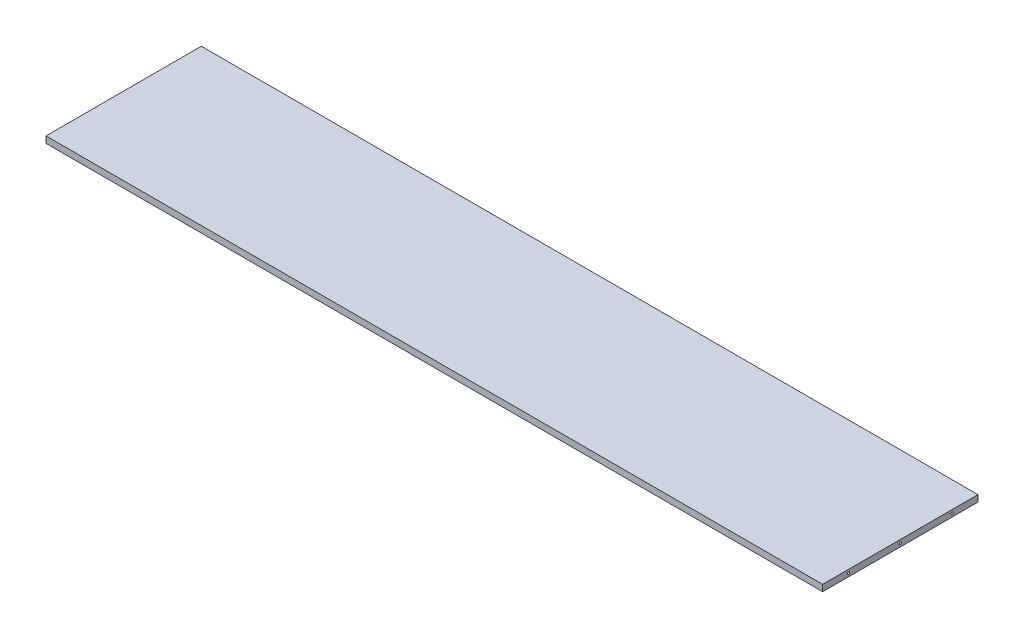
ISO-10303-21;
HEADER;
FILE_DESCRIPTION(('STEP AP214'),'2;1');
FILE_NAME('part.step','',(''),(''),'','','');
FILE_SCHEMA(('AUTOMOTIVE_DESIGN { 1 0 10303 214 1 1 1 1 }'));
ENDSEC;
DATA;
#1=APPLICATION_CONTEXT('core data for automotive mechanical design processes');
#2=APPLICATION_PROTOCOL_DEFINITION('international standard','automotive_design',2000,#1);
#3=PRODUCT_CONTEXT('',#1,'mechanical');
#4=PRODUCT('Part','Part','',(#3));
#5=PRODUCT_RELATED_PRODUCT_CATEGORY('part','',(#4));
#6=PRODUCT_DEFINITION_FORMATION('','',#4);
#7=PRODUCT_DEFINITION_CONTEXT('part definition',#1,'design');
#8=PRODUCT_DEFINITION('design','',#6,#7);
#9=PRODUCT_DEFINITION_SHAPE('','',#8);
#10=(LENGTH_UNIT() NAMED_UNIT(*) SI_UNIT(.MILLI.,.METRE.));
#11=(NAMED_UNIT(*) PLANE_ANGLE_UNIT() SI_UNIT($,.RADIAN.));
#12=(NAMED_UNIT(*) SI_UNIT($,.STERADIAN.) SOLID_ANGLE_UNIT());
#13=UNCERTAINTY_MEASURE_WITH_UNIT(LENGTH_MEASURE(1.E-05),#10,'distance_accuracy_value','');
#14=(GEOMETRIC_REPRESENTATION_CONTEXT(3) GLOBAL_UNCERTAINTY_ASSIGNED_CONTEXT((#13)) GLOBAL_UNIT_ASSIGNED_CONTEXT((#10,
#11,#12)) REPRESENTATION_CONTEXT('',''));
#15=CARTESIAN_POINT('',(0.,0.,0.));
#16=DIRECTION('',(0.,0.,1.));
#17=DIRECTION('',(1.,0.,0.));
#18=AXIS2_PLACEMENT_3D('',#15,#16,#17);
#19=CARTESIAN_POINT('',(381.,6.35,76.2));
#20=DIRECTION('',(-1.,0.,0.));
#21=DIRECTION('',(0.,0.,1.));
#22=AXIS2_PLACEMENT_3D('',#19,#20,#21);
#23=PLANE('',#22);
#24=CARTESIAN_POINT('',(381.,3.175,0.));
#25=DIRECTION('',(1.,0.,0.));
#26=DIRECTION('',(0.,0.,-1.));
#27=AXIS2_PLACEMENT_3D('',#24,#25,#26);
#28=CIRCLE('',#27,1.1303);
#29=CARTESIAN_POINT('',(381.,3.175,-1.1303));
#30=VERTEX_POINT('',#29);
#31=EDGE_CURVE('E130',#30,#30,#28,.T.);
#32=ORIENTED_EDGE('',*,*,#31,.F.);
#33=EDGE_LOOP('',(#32));
#34=FACE_BOUND('',#33,.T.);
#35=CARTESIAN_POINT('',(381.,3.175,-50.8));
#36=DIRECTION('',(1.,0.,0.));
#37=DIRECTION('',(0.,0.,-1.));
#38=AXIS2_PLACEMENT_3D('',#35,#36,#37);
#39=CIRCLE('',#38,1.1303);
#40=CARTESIAN_POINT('',(381.,3.175,-51.9303));
#41=VERTEX_POINT('',#40);
#42=EDGE_CURVE('E136',#41,#41,#39,.T.);
#43=ORIENTED_EDGE('',*,*,#42,.F.);
#44=EDGE_LOOP('',(#43));
#45=FACE_BOUND('',#44,.T.);
#46=CARTESIAN_POINT('',(381.,3.175,50.8));
#47=DIRECTION('',(1.,0.,0.));
#48=DIRECTION('',(0.,0.,-1.));
#49=AXIS2_PLACEMENT_3D('',#46,#47,#48);
#50=CIRCLE('',#49,1.1303);
#51=CARTESIAN_POINT('',(381.,3.175,49.6697));
#52=VERTEX_POINT('',#51);
#53=EDGE_CURVE('E142',#52,#52,#50,.T.);
#54=ORIENTED_EDGE('',*,*,#53,.F.);
#55=EDGE_LOOP('',(#54));
#56=FACE_BOUND('',#55,.T.);
#57=DIRECTION('',(0.,0.,-1.));
#58=VECTOR('',#57,1.);
#59=CARTESIAN_POINT('',(381.,0.,76.2));
#60=LINE('',#59,#58);
#61=CARTESIAN_POINT('',(381.,0.,76.2));
#62=VERTEX_POINT('',#61);
#63=CARTESIAN_POINT('',(381.,0.,-76.2));
#64=VERTEX_POINT('',#63);
#65=EDGE_CURVE('E148',#62,#64,#60,.T.);
#66=ORIENTED_EDGE('',*,*,#65,.T.);
#67=DIRECTION('',(0.,-1.,0.));
#68=VECTOR('',#67,1.);
#69=CARTESIAN_POINT('',(381.,6.35,-76.2));
#70=LINE('',#69,#68);
#71=CARTESIAN_POINT('',(381.,6.35,-76.2));
#72=VERTEX_POINT('',#71);
#73=EDGE_CURVE('E11',#72,#64,#70,.T.);
#74=ORIENTED_EDGE('',*,*,#73,.F.);
#75=DIRECTION('',(0.,0.,-1.));
#76=VECTOR('',#75,1.);
#77=CARTESIAN_POINT('',(381.,6.35,76.2));
#78=LINE('',#77,#76);
#79=CARTESIAN_POINT('',(381.,6.35,76.2));
#80=VERTEX_POINT('',#79);
#81=EDGE_CURVE('E149',#80,#72,#78,.T.);
#82=ORIENTED_EDGE('',*,*,#81,.F.);
#83=DIRECTION('',(0.,-1.,0.));
#84=VECTOR('',#83,1.);
#85=CARTESIAN_POINT('',(381.,6.35,76.2));
#86=LINE('',#85,#84);
#87=EDGE_CURVE('E155',#80,#62,#86,.T.);
#88=ORIENTED_EDGE('',*,*,#87,.T.);
#89=EDGE_LOOP('',(#66,#74,#82,#88));
#90=FACE_BOUND('',#89,.T.);
#91=ADVANCED_FACE('F37',(#34,#45,#56,#90),#23,.F.);
#92=CARTESIAN_POINT('',(-381.,6.35,-76.2));
#93=DIRECTION('',(0.,0.,1.));
#94=DIRECTION('',(1.,0.,0.));
#95=AXIS2_PLACEMENT_3D('',#92,#93,#94);
#96=PLANE('',#95);
#97=DIRECTION('',(-1.,0.,0.));
#98=VECTOR('',#97,1.);
#99=CARTESIAN_POINT('',(-381.,0.,-76.2));
#100=LINE('',#99,#98);
#101=CARTESIAN_POINT('',(-381.,0.,-76.2));
#102=VERTEX_POINT('',#101);
#103=EDGE_CURVE('E158',#64,#102,#100,.T.);
#104=ORIENTED_EDGE('',*,*,#103,.T.);
#105=DIRECTION('',(0.,-1.,0.));
#106=VECTOR('',#105,1.);
#107=CARTESIAN_POINT('',(-381.,6.35,-76.2));
#108=LINE('',#107,#106);
#109=CARTESIAN_POINT('',(-381.,6.35,-76.2));
#110=VERTEX_POINT('',#109);
#111=EDGE_CURVE('E45',#110,#102,#108,.T.);
#112=ORIENTED_EDGE('',*,*,#111,.F.);
#113=DIRECTION('',(-1.,0.,0.));
#114=VECTOR('',#113,1.);
#115=CARTESIAN_POINT('',(-381.,6.35,-76.2));
#116=LINE('',#115,#114);
#117=EDGE_CURVE('E84',#72,#110,#116,.T.);
#118=ORIENTED_EDGE('',*,*,#117,.F.);
#119=ORIENTED_EDGE('',*,*,#73,.T.);
#120=EDGE_LOOP('',(#104,#112,#118,#119));
#121=FACE_BOUND('',#120,.T.);
#122=ADVANCED_FACE('F181',(#121),#96,.F.);
#123=CARTESIAN_POINT('',(-381.,6.35,76.2));
#124=DIRECTION('',(1.,0.,0.));
#125=DIRECTION('',(0.,0.,-1.));
#126=AXIS2_PLACEMENT_3D('',#123,#124,#125);
#127=PLANE('',#126);
#128=CARTESIAN_POINT('',(-381.,3.175,0.));
#129=DIRECTION('',(-1.,0.,0.));
#130=DIRECTION('',(0.,0.,1.));
#131=AXIS2_PLACEMENT_3D('',#128,#129,#130);
#132=CIRCLE('',#131,1.13029999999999);
#133=CARTESIAN_POINT('',(-381.,3.175,1.13029999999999));
#134=VERTEX_POINT('',#133);
#135=EDGE_CURVE('E114',#134,#134,#132,.T.);
#136=ORIENTED_EDGE('',*,*,#135,.F.);
#137=EDGE_LOOP('',(#136));
#138=FACE_BOUND('',#137,.T.);
#139=CARTESIAN_POINT('',(-381.,3.175,50.8));
#140=DIRECTION('',(-1.,0.,0.));
#141=DIRECTION('',(0.,0.,1.));
#142=AXIS2_PLACEMENT_3D('',#139,#140,#141);
#143=CIRCLE('',#142,1.13029999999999);
#144=CARTESIAN_POINT('',(-381.,3.175,51.9303));
#145=VERTEX_POINT('',#144);
#146=EDGE_CURVE('E113',#145,#145,#143,.T.);
#147=ORIENTED_EDGE('',*,*,#146,.F.);
#148=EDGE_LOOP('',(#147));
#149=FACE_BOUND('',#148,.T.);
#150=CARTESIAN_POINT('',(-381.,3.175,-50.8));
#151=DIRECTION('',(-1.,0.,0.));
#152=DIRECTION('',(0.,0.,1.));
#153=AXIS2_PLACEMENT_3D('',#150,#151,#152);
#154=CIRCLE('',#153,1.13029999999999);
#155=CARTESIAN_POINT('',(-381.,3.175,-49.6697));
#156=VERTEX_POINT('',#155);
#157=EDGE_CURVE('E124',#156,#156,#154,.T.);
#158=ORIENTED_EDGE('',*,*,#157,.F.);
#159=EDGE_LOOP('',(#158));
#160=FACE_BOUND('',#159,.T.);
#161=DIRECTION('',(0.,0.,1.));
#162=VECTOR('',#161,1.);
#163=CARTESIAN_POINT('',(-381.,0.,76.2));
#164=LINE('',#163,#162);
#165=CARTESIAN_POINT('',(-381.,0.,76.2));
#166=VERTEX_POINT('',#165);
#167=EDGE_CURVE('E71',#102,#166,#164,.T.);
#168=ORIENTED_EDGE('',*,*,#167,.T.);
#169=DIRECTION('',(0.,-1.,0.));
#170=VECTOR('',#169,1.);
#171=CARTESIAN_POINT('',(-381.,6.35,76.2));
#172=LINE('',#171,#170);
#173=CARTESIAN_POINT('',(-381.,6.35,76.2));
#174=VERTEX_POINT('',#173);
#175=EDGE_CURVE('E163',#174,#166,#172,.T.);
#176=ORIENTED_EDGE('',*,*,#175,.F.);
#177=DIRECTION('',(0.,0.,1.));
#178=VECTOR('',#177,1.);
#179=CARTESIAN_POINT('',(-381.,6.35,76.2));
#180=LINE('',#179,#178);
#181=EDGE_CURVE('E152',#110,#174,#180,.T.);
#182=ORIENTED_EDGE('',*,*,#181,.F.);
#183=ORIENTED_EDGE('',*,*,#111,.T.);
#184=EDGE_LOOP('',(#168,#176,#182,#183));
#185=FACE_BOUND('',#184,.T.);
#186=ADVANCED_FACE('F165',(#138,#149,#160,#185),#127,.F.);
#187=CARTESIAN_POINT('',(-381.,6.35,76.2));
#188=DIRECTION('',(0.,0.,-1.));
#189=DIRECTION('',(-1.,0.,0.));
#190=AXIS2_PLACEMENT_3D('',#187,#188,#189);
#191=PLANE('',#190);
#192=DIRECTION('',(1.,0.,0.));
#193=VECTOR('',#192,1.);
#194=CARTESIAN_POINT('',(-381.,0.,76.2));
#195=LINE('',#194,#193);
#196=EDGE_CURVE('E77',#166,#62,#195,.T.);
#197=ORIENTED_EDGE('',*,*,#196,.T.);
#198=ORIENTED_EDGE('',*,*,#87,.F.);
#199=DIRECTION('',(1.,0.,0.));
#200=VECTOR('',#199,1.);
#201=CARTESIAN_POINT('',(-381.,6.35,76.2));
#202=LINE('',#201,#200);
#203=EDGE_CURVE('E53',#174,#80,#202,.T.);
#204=ORIENTED_EDGE('',*,*,#203,.F.);
#205=ORIENTED_EDGE('',*,*,#175,.T.);
#206=EDGE_LOOP('',(#197,#198,#204,#205));
#207=FACE_BOUND('',#206,.T.);
#208=ADVANCED_FACE('F172',(#207),#191,.F.);
#209=CARTESIAN_POINT('',(0.,6.35,0.));
#210=DIRECTION('',(0.,-1.,0.));
#211=DIRECTION('',(0.,0.,-1.));
#212=AXIS2_PLACEMENT_3D('',#209,#210,#211);
#213=PLANE('',#212);
#214=ORIENTED_EDGE('',*,*,#81,.T.);
#215=ORIENTED_EDGE('',*,*,#117,.T.);
#216=ORIENTED_EDGE('',*,*,#181,.T.);
#217=ORIENTED_EDGE('',*,*,#203,.T.);
#218=EDGE_LOOP('',(#214,#215,#216,#217));
#219=FACE_BOUND('',#218,.T.);
#220=ADVANCED_FACE('F174',(#219),#213,.F.);
#221=CARTESIAN_POINT('',(0.,0.,0.));
#222=DIRECTION('',(0.,-1.,0.));
#223=DIRECTION('',(0.,0.,-1.));
#224=AXIS2_PLACEMENT_3D('',#221,#222,#223);
#225=PLANE('',#224);
#226=ORIENTED_EDGE('',*,*,#65,.F.);
#227=ORIENTED_EDGE('',*,*,#196,.F.);
#228=ORIENTED_EDGE('',*,*,#167,.F.);
#229=ORIENTED_EDGE('',*,*,#103,.F.);
#230=EDGE_LOOP('',(#226,#227,#228,#229));
#231=FACE_BOUND('',#230,.T.);
#232=ADVANCED_FACE('F168',(#231),#225,.T.);
#233=CARTESIAN_POINT('',(373.4054,3.175,50.8));
#234=DIRECTION('',(1.,0.,0.));
#235=DIRECTION('',(0.,0.,-1.));
#236=AXIS2_PLACEMENT_3D('',#233,#234,#235);
#237=CONICAL_SURFACE('',#236,1.1303,1.02974425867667);
#238=CARTESIAN_POINT('',(372.726247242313,3.175,50.8));
#239=VERTEX_POINT('',#238);
#240=VERTEX_LOOP('',#239);
#241=FACE_BOUND('',#240,.T.);
#242=CARTESIAN_POINT('',(373.4054,3.175,50.8));
#243=DIRECTION('',(1.,0.,0.));
#244=DIRECTION('',(0.,0.,-1.));
#245=AXIS2_PLACEMENT_3D('',#242,#243,#244);
#246=CIRCLE('',#245,1.1303);
#247=CARTESIAN_POINT('',(373.4054,3.175,49.6697));
#248=VERTEX_POINT('',#247);
#249=EDGE_CURVE('E145',#248,#248,#246,.T.);
#250=ORIENTED_EDGE('',*,*,#249,.T.);
#251=EDGE_LOOP('',(#250));
#252=FACE_BOUND('',#251,.T.);
#253=ADVANCED_FACE('F199',(#241,#252),#237,.F.);
#254=CARTESIAN_POINT('',(381.,3.175,50.8));
#255=DIRECTION('',(1.,0.,0.));
#256=DIRECTION('',(0.,0.,-1.));
#257=AXIS2_PLACEMENT_3D('',#254,#255,#256);
#258=CYLINDRICAL_SURFACE('',#257,1.1303);
#259=ORIENTED_EDGE('',*,*,#249,.F.);
#260=EDGE_LOOP('',(#259));
#261=FACE_BOUND('',#260,.T.);
#262=ORIENTED_EDGE('',*,*,#53,.T.);
#263=EDGE_LOOP('',(#262));
#264=FACE_BOUND('',#263,.T.);
#265=ADVANCED_FACE('F196',(#261,#264),#258,.F.);
#266=CARTESIAN_POINT('',(373.4054,3.175,-50.8));
#267=DIRECTION('',(1.,0.,0.));
#268=DIRECTION('',(0.,0.,-1.));
#269=AXIS2_PLACEMENT_3D('',#266,#267,#268);
#270=CONICAL_SURFACE('',#269,1.1303,1.02974425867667);
#271=CARTESIAN_POINT('',(372.726247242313,3.175,-50.8));
#272=VERTEX_POINT('',#271);
#273=VERTEX_LOOP('',#272);
#274=FACE_BOUND('',#273,.T.);
#275=CARTESIAN_POINT('',(373.4054,3.175,-50.8));
#276=DIRECTION('',(1.,0.,0.));
#277=DIRECTION('',(0.,0.,-1.));
#278=AXIS2_PLACEMENT_3D('',#275,#276,#277);
#279=CIRCLE('',#278,1.1303);
#280=CARTESIAN_POINT('',(373.4054,3.175,-51.9303));
#281=VERTEX_POINT('',#280);
#282=EDGE_CURVE('E139',#281,#281,#279,.T.);
#283=ORIENTED_EDGE('',*,*,#282,.T.);
#284=EDGE_LOOP('',(#283));
#285=FACE_BOUND('',#284,.T.);
#286=ADVANCED_FACE('F198',(#274,#285),#270,.F.);
#287=CARTESIAN_POINT('',(381.,3.175,-50.8));
#288=DIRECTION('',(1.,0.,0.));
#289=DIRECTION('',(0.,0.,-1.));
#290=AXIS2_PLACEMENT_3D('',#287,#288,#289);
#291=CYLINDRICAL_SURFACE('',#290,1.1303);
#292=ORIENTED_EDGE('',*,*,#282,.F.);
#293=EDGE_LOOP('',(#292));
#294=FACE_BOUND('',#293,.T.);
#295=ORIENTED_EDGE('',*,*,#42,.T.);
#296=EDGE_LOOP('',(#295));
#297=FACE_BOUND('',#296,.T.);
#298=ADVANCED_FACE('F206',(#294,#297),#291,.F.);
#299=CARTESIAN_POINT('',(373.4054,3.175,0.));
#300=DIRECTION('',(1.,0.,0.));
#301=DIRECTION('',(0.,0.,-1.));
#302=AXIS2_PLACEMENT_3D('',#299,#300,#301);
#303=CONICAL_SURFACE('',#302,1.1303,1.02974425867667);
#304=CARTESIAN_POINT('',(372.726247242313,3.175,0.));
#305=VERTEX_POINT('',#304);
#306=VERTEX_LOOP('',#305);
#307=FACE_BOUND('',#306,.T.);
#308=CARTESIAN_POINT('',(373.4054,3.175,0.));
#309=DIRECTION('',(1.,0.,0.));
#310=DIRECTION('',(0.,0.,-1.));
#311=AXIS2_PLACEMENT_3D('',#308,#309,#310);
#312=CIRCLE('',#311,1.1303);
#313=CARTESIAN_POINT('',(373.4054,3.175,-1.1303));
#314=VERTEX_POINT('',#313);
#315=EDGE_CURVE('E133',#314,#314,#312,.T.);
#316=ORIENTED_EDGE('',*,*,#315,.T.);
#317=EDGE_LOOP('',(#316));
#318=FACE_BOUND('',#317,.T.);
#319=ADVANCED_FACE('F246',(#307,#318),#303,.F.);
#320=CARTESIAN_POINT('',(381.,3.175,0.));
#321=DIRECTION('',(1.,0.,0.));
#322=DIRECTION('',(0.,0.,-1.));
#323=AXIS2_PLACEMENT_3D('',#320,#321,#322);
#324=CYLINDRICAL_SURFACE('',#323,1.1303);
#325=ORIENTED_EDGE('',*,*,#315,.F.);
#326=EDGE_LOOP('',(#325));
#327=FACE_BOUND('',#326,.T.);
#328=ORIENTED_EDGE('',*,*,#31,.T.);
#329=EDGE_LOOP('',(#328));
#330=FACE_BOUND('',#329,.T.);
#331=ADVANCED_FACE('F256',(#327,#330),#324,.F.);
#332=CARTESIAN_POINT('',(-373.4054,3.175,-50.8));
#333=DIRECTION('',(-1.,0.,0.));
#334=DIRECTION('',(0.,0.,1.));
#335=AXIS2_PLACEMENT_3D('',#332,#333,#334);
#336=CONICAL_SURFACE('',#335,1.13029999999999,1.02974425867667);
#337=CARTESIAN_POINT('',(-372.726247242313,3.175,-50.8));
#338=VERTEX_POINT('',#337);
#339=VERTEX_LOOP('',#338);
#340=FACE_BOUND('',#339,.T.);
#341=CARTESIAN_POINT('',(-373.4054,3.175,-50.8));
#342=DIRECTION('',(-1.,0.,0.));
#343=DIRECTION('',(0.,0.,1.));
#344=AXIS2_PLACEMENT_3D('',#341,#342,#343);
#345=CIRCLE('',#344,1.13029999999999);
#346=CARTESIAN_POINT('',(-373.4054,3.175,-49.6697));
#347=VERTEX_POINT('',#346);
#348=EDGE_CURVE('E127',#347,#347,#345,.T.);
#349=ORIENTED_EDGE('',*,*,#348,.T.);
#350=EDGE_LOOP('',(#349));
#351=FACE_BOUND('',#350,.T.);
#352=ADVANCED_FACE('F267',(#340,#351),#336,.F.);
#353=CARTESIAN_POINT('',(-381.,3.175,-50.8));
#354=DIRECTION('',(-1.,0.,0.));
#355=DIRECTION('',(0.,0.,1.));
#356=AXIS2_PLACEMENT_3D('',#353,#354,#355);
#357=CYLINDRICAL_SURFACE('',#356,1.13029999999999);
#358=ORIENTED_EDGE('',*,*,#348,.F.);
#359=EDGE_LOOP('',(#358));
#360=FACE_BOUND('',#359,.T.);
#361=ORIENTED_EDGE('',*,*,#157,.T.);
#362=EDGE_LOOP('',(#361));
#363=FACE_BOUND('',#362,.T.);
#364=ADVANCED_FACE('F287',(#360,#363),#357,.F.);
#365=CARTESIAN_POINT('',(-373.4054,3.175,50.8));
#366=DIRECTION('',(-1.,0.,0.));
#367=DIRECTION('',(0.,0.,1.));
#368=AXIS2_PLACEMENT_3D('',#365,#366,#367);
#369=CONICAL_SURFACE('',#368,1.13029999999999,1.02974425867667);
#370=CARTESIAN_POINT('',(-372.726247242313,3.175,50.8));
#371=VERTEX_POINT('',#370);
#372=VERTEX_LOOP('',#371);
#373=FACE_BOUND('',#372,.T.);
#374=CARTESIAN_POINT('',(-373.4054,3.175,50.8));
#375=DIRECTION('',(-1.,0.,0.));
#376=DIRECTION('',(0.,0.,1.));
#377=AXIS2_PLACEMENT_3D('',#374,#375,#376);
#378=CIRCLE('',#377,1.13029999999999);
#379=CARTESIAN_POINT('',(-373.4054,3.175,51.9303));
#380=VERTEX_POINT('',#379);
#381=EDGE_CURVE('E117',#380,#380,#378,.T.);
#382=ORIENTED_EDGE('',*,*,#381,.T.);
#383=EDGE_LOOP('',(#382));
#384=FACE_BOUND('',#383,.T.);
#385=ADVANCED_FACE('F298',(#373,#384),#369,.F.);
#386=CARTESIAN_POINT('',(-381.,3.175,50.8));
#387=DIRECTION('',(-1.,0.,0.));
#388=DIRECTION('',(0.,0.,1.));
#389=AXIS2_PLACEMENT_3D('',#386,#387,#388);
#390=CYLINDRICAL_SURFACE('',#389,1.13029999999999);
#391=ORIENTED_EDGE('',*,*,#381,.F.);
#392=EDGE_LOOP('',(#391));
#393=FACE_BOUND('',#392,.T.);
#394=ORIENTED_EDGE('',*,*,#146,.T.);
#395=EDGE_LOOP('',(#394));
#396=FACE_BOUND('',#395,.T.);
#397=ADVANCED_FACE('F107',(#393,#396),#390,.F.);
#398=CARTESIAN_POINT('',(-373.4054,3.175,0.));
#399=DIRECTION('',(-1.,0.,0.));
#400=DIRECTION('',(0.,0.,1.));
#401=AXIS2_PLACEMENT_3D('',#398,#399,#400);
#402=CONICAL_SURFACE('',#401,1.13029999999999,1.02974425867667);
#403=CARTESIAN_POINT('',(-372.726247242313,3.175,0.));
#404=VERTEX_POINT('',#403);
#405=VERTEX_LOOP('',#404);
#406=FACE_BOUND('',#405,.T.);
#407=CARTESIAN_POINT('',(-373.4054,3.175,0.));
#408=DIRECTION('',(-1.,0.,0.));
#409=DIRECTION('',(0.,0.,1.));
#410=AXIS2_PLACEMENT_3D('',#407,#408,#409);
#411=CIRCLE('',#410,1.13029999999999);
#412=CARTESIAN_POINT('',(-373.4054,3.175,1.13029999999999));
#413=VERTEX_POINT('',#412);
#414=EDGE_CURVE('E111',#413,#413,#411,.T.);
#415=ORIENTED_EDGE('',*,*,#414,.T.);
#416=EDGE_LOOP('',(#415));
#417=FACE_BOUND('',#416,.T.);
#418=ADVANCED_FACE('F103',(#406,#417),#402,.F.);
#419=CARTESIAN_POINT('',(-381.,3.175,0.));
#420=DIRECTION('',(-1.,0.,0.));
#421=DIRECTION('',(0.,0.,1.));
#422=AXIS2_PLACEMENT_3D('',#419,#420,#421);
#423=CYLINDRICAL_SURFACE('',#422,1.13029999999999);
#424=ORIENTED_EDGE('',*,*,#414,.F.);
#425=EDGE_LOOP('',(#424));
#426=FACE_BOUND('',#425,.T.);
#427=ORIENTED_EDGE('',*,*,#135,.T.);
#428=EDGE_LOOP('',(#427));
#429=FACE_BOUND('',#428,.T.);
#430=ADVANCED_FACE('F106',(#426,#429),#423,.F.);
#431=CLOSED_SHELL('',(#91,#122,#186,#208,#220,#232,#253,#265,#286,#298,#319,#331,#352,#364,#385,
#397,#418,#430));
#432=MANIFOLD_SOLID_BREP('B2',#431);
#433=ADVANCED_BREP_SHAPE_REPRESENTATION('',(#18,#432),#14);
#434=SHAPE_DEFINITION_REPRESENTATION(#9,#433);
ENDSEC;
END-ISO-10303-21;
